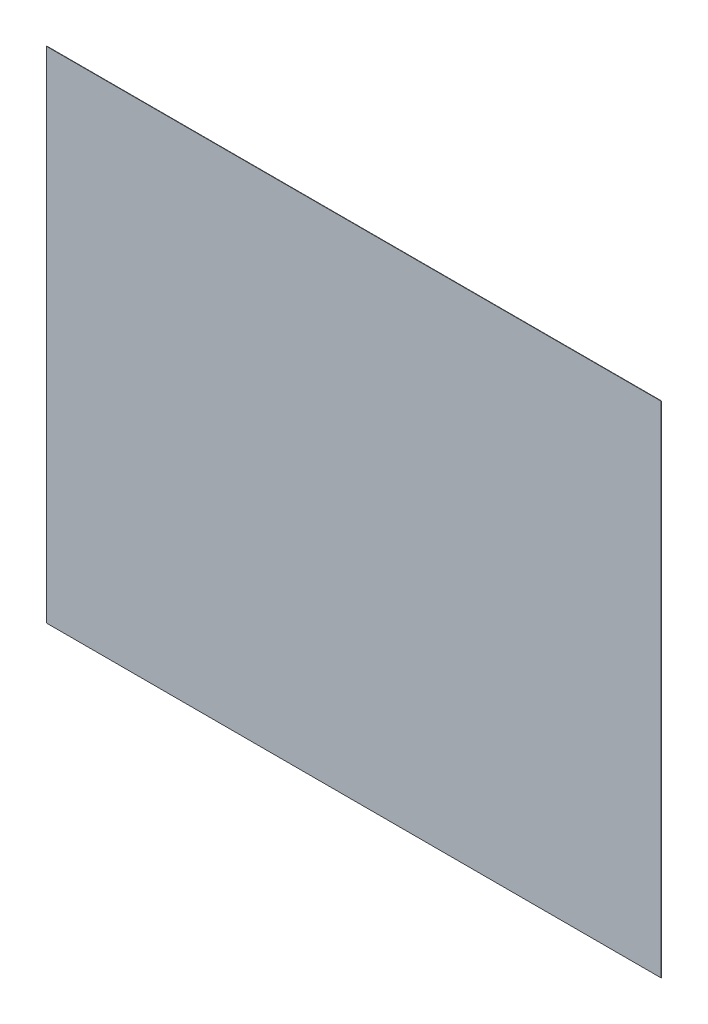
from build123d import *

# Parameters (mm, degrees)
SCHIZZO1_W                   = 1600
SCHIZZO1_H                   = 1300
ESTRUSIONE_ESTRUSIONE1_DEPTH = 1


with BuildPart() as part:
    # Schizzo1 → Estrusione-Estrusione1 (new body)
    with BuildSketch(Plane.XY):
        Rectangle(SCHIZZO1_W, SCHIZZO1_H)
    extrude(amount=ESTRUSIONE_ESTRUSIONE1_DEPTH)


solid = part.part
